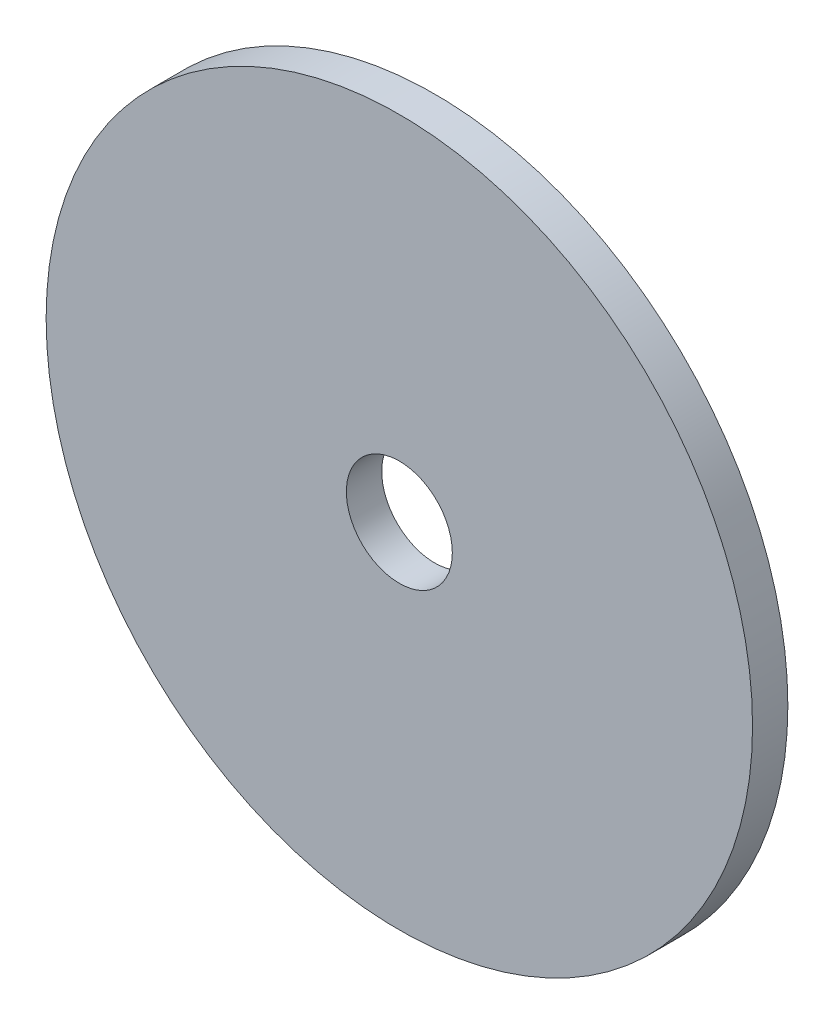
ISO-10303-21;
HEADER;
FILE_DESCRIPTION(('STEP AP214'),'2;1');
FILE_NAME('part.step','',(''),(''),'','','');
FILE_SCHEMA(('AUTOMOTIVE_DESIGN { 1 0 10303 214 1 1 1 1 }'));
ENDSEC;
DATA;
#1=APPLICATION_CONTEXT('core data for automotive mechanical design processes');
#2=APPLICATION_PROTOCOL_DEFINITION('international standard','automotive_design',2000,#1);
#3=PRODUCT_CONTEXT('',#1,'mechanical');
#4=PRODUCT('Part','Part','',(#3));
#5=PRODUCT_RELATED_PRODUCT_CATEGORY('part','',(#4));
#6=PRODUCT_DEFINITION_FORMATION('','',#4);
#7=PRODUCT_DEFINITION_CONTEXT('part definition',#1,'design');
#8=PRODUCT_DEFINITION('design','',#6,#7);
#9=PRODUCT_DEFINITION_SHAPE('','',#8);
#10=(LENGTH_UNIT() NAMED_UNIT(*) SI_UNIT(.MILLI.,.METRE.));
#11=(NAMED_UNIT(*) PLANE_ANGLE_UNIT() SI_UNIT($,.RADIAN.));
#12=(NAMED_UNIT(*) SI_UNIT($,.STERADIAN.) SOLID_ANGLE_UNIT());
#13=UNCERTAINTY_MEASURE_WITH_UNIT(LENGTH_MEASURE(1.E-05),#10,'distance_accuracy_value','');
#14=(GEOMETRIC_REPRESENTATION_CONTEXT(3) GLOBAL_UNCERTAINTY_ASSIGNED_CONTEXT((#13)) GLOBAL_UNIT_ASSIGNED_CONTEXT((#10,
#11,#12)) REPRESENTATION_CONTEXT('',''));
#15=CARTESIAN_POINT('',(0.,0.,0.));
#16=DIRECTION('',(0.,0.,1.));
#17=DIRECTION('',(1.,0.,0.));
#18=AXIS2_PLACEMENT_3D('',#15,#16,#17);
#19=CARTESIAN_POINT('',(-179.631517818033,-192.05336497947,0.));
#20=DIRECTION('',(0.,0.,1.));
#21=DIRECTION('',(-1.,0.,0.));
#22=AXIS2_PLACEMENT_3D('',#19,#20,#21);
#23=CYLINDRICAL_SURFACE('',#22,4.7625);
#24=CARTESIAN_POINT('',(-179.631517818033,-192.05336497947,3.175));
#25=DIRECTION('',(0.,0.,1.));
#26=DIRECTION('',(-1.,0.,0.));
#27=AXIS2_PLACEMENT_3D('',#24,#25,#26);
#28=CIRCLE('',#27,4.7625);
#29=CARTESIAN_POINT('',(-174.869017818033,-192.05336497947,3.175));
#30=VERTEX_POINT('',#29);
#31=EDGE_CURVE('E11',#30,#30,#28,.T.);
#32=ORIENTED_EDGE('',*,*,#31,.T.);
#33=EDGE_LOOP('',(#32));
#34=FACE_BOUND('',#33,.T.);
#35=CARTESIAN_POINT('',(-179.631517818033,-192.05336497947,0.));
#36=DIRECTION('',(0.,0.,-1.));
#37=DIRECTION('',(-1.,0.,0.));
#38=AXIS2_PLACEMENT_3D('',#35,#36,#37);
#39=CIRCLE('',#38,4.7625);
#40=CARTESIAN_POINT('',(-174.869017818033,-192.05336497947,0.));
#41=VERTEX_POINT('',#40);
#42=EDGE_CURVE('E25',#41,#41,#39,.T.);
#43=ORIENTED_EDGE('',*,*,#42,.T.);
#44=EDGE_LOOP('',(#43));
#45=FACE_BOUND('',#44,.T.);
#46=ADVANCED_FACE('F16',(#34,#45),#23,.F.);
#47=CARTESIAN_POINT('',(-179.631517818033,-192.05336497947,0.));
#48=DIRECTION('',(0.,0.,1.));
#49=DIRECTION('',(1.,0.,0.));
#50=AXIS2_PLACEMENT_3D('',#47,#48,#49);
#51=CYLINDRICAL_SURFACE('',#50,31.75);
#52=CARTESIAN_POINT('',(-179.631517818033,-192.05336497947,3.175));
#53=DIRECTION('',(0.,0.,-1.));
#54=DIRECTION('',(1.,0.,0.));
#55=AXIS2_PLACEMENT_3D('',#52,#53,#54);
#56=CIRCLE('',#55,31.75);
#57=CARTESIAN_POINT('',(-147.881517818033,-192.05336497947,3.175));
#58=VERTEX_POINT('',#57);
#59=EDGE_CURVE('E42',#58,#58,#56,.T.);
#60=ORIENTED_EDGE('',*,*,#59,.T.);
#61=EDGE_LOOP('',(#60));
#62=FACE_BOUND('',#61,.T.);
#63=CARTESIAN_POINT('',(-179.631517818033,-192.05336497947,0.));
#64=DIRECTION('',(0.,0.,1.));
#65=DIRECTION('',(1.,0.,0.));
#66=AXIS2_PLACEMENT_3D('',#63,#64,#65);
#67=CIRCLE('',#66,31.75);
#68=CARTESIAN_POINT('',(-147.881517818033,-192.05336497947,0.));
#69=VERTEX_POINT('',#68);
#70=EDGE_CURVE('E46',#69,#69,#67,.T.);
#71=ORIENTED_EDGE('',*,*,#70,.T.);
#72=EDGE_LOOP('',(#71));
#73=FACE_BOUND('',#72,.T.);
#74=ADVANCED_FACE('F62',(#62,#73),#51,.T.);
#75=CARTESIAN_POINT('',(-177.065164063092,-192.05336497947,3.175));
#76=DIRECTION('',(0.,0.,1.));
#77=DIRECTION('',(1.,0.,0.));
#78=AXIS2_PLACEMENT_3D('',#75,#76,#77);
#79=PLANE('',#78);
#80=ORIENTED_EDGE('',*,*,#59,.F.);
#81=EDGE_LOOP('',(#80));
#82=FACE_BOUND('',#81,.T.);
#83=ORIENTED_EDGE('',*,*,#31,.F.);
#84=EDGE_LOOP('',(#83));
#85=FACE_BOUND('',#84,.T.);
#86=ADVANCED_FACE('F57',(#82,#85),#79,.T.);
#87=CARTESIAN_POINT('',(-177.065164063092,-192.05336497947,0.));
#88=DIRECTION('',(0.,0.,1.));
#89=DIRECTION('',(1.,0.,0.));
#90=AXIS2_PLACEMENT_3D('',#87,#88,#89);
#91=PLANE('',#90);
#92=ORIENTED_EDGE('',*,*,#70,.F.);
#93=EDGE_LOOP('',(#92));
#94=FACE_BOUND('',#93,.T.);
#95=ORIENTED_EDGE('',*,*,#42,.F.);
#96=EDGE_LOOP('',(#95));
#97=FACE_BOUND('',#96,.T.);
#98=ADVANCED_FACE('F47',(#94,#97),#91,.F.);
#99=CLOSED_SHELL('',(#46,#74,#86,#98));
#100=MANIFOLD_SOLID_BREP('B1',#99);
#101=ADVANCED_BREP_SHAPE_REPRESENTATION('',(#18,#100),#14);
#102=SHAPE_DEFINITION_REPRESENTATION(#9,#101);
ENDSEC;
END-ISO-10303-21;
